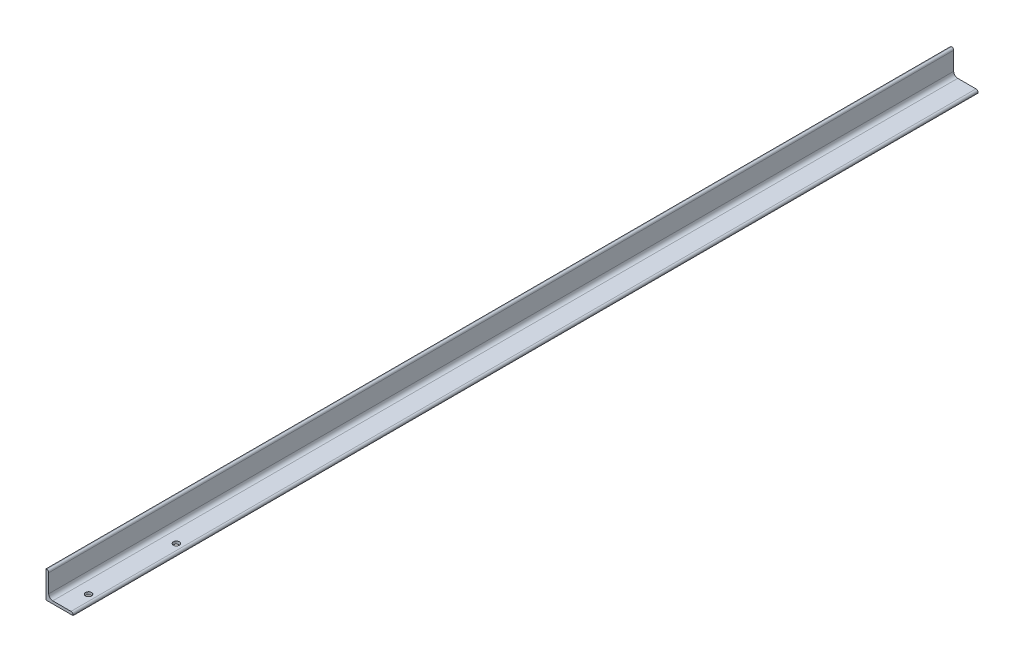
ISO-10303-21;
HEADER;
FILE_DESCRIPTION(('STEP AP214'),'2;1');
FILE_NAME('part.step','',(''),(''),'','','');
FILE_SCHEMA(('AUTOMOTIVE_DESIGN { 1 0 10303 214 1 1 1 1 }'));
ENDSEC;
DATA;
#1=APPLICATION_CONTEXT('core data for automotive mechanical design processes');
#2=APPLICATION_PROTOCOL_DEFINITION('international standard','automotive_design',2000,#1);
#3=PRODUCT_CONTEXT('',#1,'mechanical');
#4=PRODUCT('Part','Part','',(#3));
#5=PRODUCT_RELATED_PRODUCT_CATEGORY('part','',(#4));
#6=PRODUCT_DEFINITION_FORMATION('','',#4);
#7=PRODUCT_DEFINITION_CONTEXT('part definition',#1,'design');
#8=PRODUCT_DEFINITION('design','',#6,#7);
#9=PRODUCT_DEFINITION_SHAPE('','',#8);
#10=(LENGTH_UNIT() NAMED_UNIT(*) SI_UNIT(.MILLI.,.METRE.));
#11=(NAMED_UNIT(*) PLANE_ANGLE_UNIT() SI_UNIT($,.RADIAN.));
#12=(NAMED_UNIT(*) SI_UNIT($,.STERADIAN.) SOLID_ANGLE_UNIT());
#13=UNCERTAINTY_MEASURE_WITH_UNIT(LENGTH_MEASURE(1.E-05),#10,'distance_accuracy_value','');
#14=(GEOMETRIC_REPRESENTATION_CONTEXT(3) GLOBAL_UNCERTAINTY_ASSIGNED_CONTEXT((#13)) GLOBAL_UNIT_ASSIGNED_CONTEXT((#10,
#11,#12)) REPRESENTATION_CONTEXT('',''));
#15=CARTESIAN_POINT('',(0.,0.,0.));
#16=DIRECTION('',(0.,0.,1.));
#17=DIRECTION('',(1.,0.,0.));
#18=AXIS2_PLACEMENT_3D('',#15,#16,#17);
#19=CARTESIAN_POINT('',(20.,-20.,670.));
#20=DIRECTION('',(0.,1.,0.));
#21=DIRECTION('',(0.,0.,1.));
#22=AXIS2_PLACEMENT_3D('',#19,#20,#21);
#23=PLANE('',#22);
#24=CARTESIAN_POINT('',(8.,-20.,635.));
#25=DIRECTION('',(0.,-1.,0.));
#26=DIRECTION('',(0.,0.,-1.));
#27=AXIS2_PLACEMENT_3D('',#24,#25,#26);
#28=CIRCLE('',#27,4.5);
#29=CARTESIAN_POINT('',(8.,-20.,630.5));
#30=VERTEX_POINT('',#29);
#31=EDGE_CURVE('E204',#30,#30,#28,.T.);
#32=ORIENTED_EDGE('',*,*,#31,.F.);
#33=EDGE_LOOP('',(#32));
#34=FACE_BOUND('',#33,.T.);
#35=CARTESIAN_POINT('',(8.,-20.,505.));
#36=DIRECTION('',(0.,-1.,0.));
#37=DIRECTION('',(0.,0.,-1.));
#38=AXIS2_PLACEMENT_3D('',#35,#36,#37);
#39=CIRCLE('',#38,4.5);
#40=CARTESIAN_POINT('',(8.,-20.,500.5));
#41=VERTEX_POINT('',#40);
#42=EDGE_CURVE('E198',#41,#41,#39,.T.);
#43=ORIENTED_EDGE('',*,*,#42,.F.);
#44=EDGE_LOOP('',(#43));
#45=FACE_BOUND('',#44,.T.);
#46=DIRECTION('',(1.,0.,0.));
#47=VECTOR('',#46,1.);
#48=CARTESIAN_POINT('',(20.,-20.,-670.));
#49=LINE('',#48,#47);
#50=CARTESIAN_POINT('',(-20.,-20.,-670.));
#51=VERTEX_POINT('',#50);
#52=CARTESIAN_POINT('',(20.,-20.,-670.));
#53=VERTEX_POINT('',#52);
#54=EDGE_CURVE('E138',#51,#53,#49,.T.);
#55=ORIENTED_EDGE('',*,*,#54,.T.);
#56=DIRECTION('',(0.,0.,-1.));
#57=VECTOR('',#56,1.);
#58=CARTESIAN_POINT('',(20.,-20.,670.));
#59=LINE('',#58,#57);
#60=CARTESIAN_POINT('',(20.,-20.,670.));
#61=VERTEX_POINT('',#60);
#62=EDGE_CURVE('E11',#61,#53,#59,.T.);
#63=ORIENTED_EDGE('',*,*,#62,.F.);
#64=DIRECTION('',(1.,0.,0.));
#65=VECTOR('',#64,1.);
#66=CARTESIAN_POINT('',(20.,-20.,670.));
#67=LINE('',#66,#65);
#68=CARTESIAN_POINT('',(-20.,-20.,670.));
#69=VERTEX_POINT('',#68);
#70=EDGE_CURVE('E155',#69,#61,#67,.T.);
#71=ORIENTED_EDGE('',*,*,#70,.F.);
#72=DIRECTION('',(0.,0.,-1.));
#73=VECTOR('',#72,1.);
#74=CARTESIAN_POINT('',(-20.,-20.,670.));
#75=LINE('',#74,#73);
#76=EDGE_CURVE('E134',#69,#51,#75,.T.);
#77=ORIENTED_EDGE('',*,*,#76,.T.);
#78=EDGE_LOOP('',(#55,#63,#71,#77));
#79=FACE_BOUND('',#78,.T.);
#80=ADVANCED_FACE('F36',(#34,#45,#79),#23,.F.);
#81=CARTESIAN_POINT('',(20.,-20.,670.));
#82=DIRECTION('',(-1.,0.,0.));
#83=DIRECTION('',(0.,0.,1.));
#84=AXIS2_PLACEMENT_3D('',#81,#82,#83);
#85=PLANE('',#84);
#86=DIRECTION('',(0.,1.,0.));
#87=VECTOR('',#86,1.);
#88=CARTESIAN_POINT('',(20.,-20.,-670.));
#89=LINE('',#88,#87);
#90=CARTESIAN_POINT('',(20.,-19.,-670.));
#91=VERTEX_POINT('',#90);
#92=EDGE_CURVE('E141',#53,#91,#89,.T.);
#93=ORIENTED_EDGE('',*,*,#92,.T.);
#94=DIRECTION('',(0.,0.,-1.));
#95=VECTOR('',#94,1.);
#96=CARTESIAN_POINT('',(20.,-19.,670.));
#97=LINE('',#96,#95);
#98=CARTESIAN_POINT('',(20.,-19.,670.));
#99=VERTEX_POINT('',#98);
#100=EDGE_CURVE('E44',#99,#91,#97,.T.);
#101=ORIENTED_EDGE('',*,*,#100,.F.);
#102=DIRECTION('',(0.,1.,0.));
#103=VECTOR('',#102,1.);
#104=CARTESIAN_POINT('',(20.,-20.,670.));
#105=LINE('',#104,#103);
#106=EDGE_CURVE('E98',#61,#99,#105,.T.);
#107=ORIENTED_EDGE('',*,*,#106,.F.);
#108=ORIENTED_EDGE('',*,*,#62,.T.);
#109=EDGE_LOOP('',(#93,#101,#107,#108));
#110=FACE_BOUND('',#109,.T.);
#111=ADVANCED_FACE('F213',(#110),#85,.F.);
#112=CARTESIAN_POINT('',(17.,-19.,670.));
#113=DIRECTION('',(0.,0.,-1.));
#114=DIRECTION('',(-1.,0.,0.));
#115=AXIS2_PLACEMENT_3D('',#112,#113,#114);
#116=CYLINDRICAL_SURFACE('',#115,3.);
#117=CARTESIAN_POINT('',(17.,-19.,-670.));
#118=DIRECTION('',(0.,0.,1.));
#119=DIRECTION('',(1.,0.,0.));
#120=AXIS2_PLACEMENT_3D('',#117,#118,#119);
#121=CIRCLE('',#120,3.);
#122=CARTESIAN_POINT('',(17.,-16.,-670.));
#123=VERTEX_POINT('',#122);
#124=EDGE_CURVE('E144',#91,#123,#121,.T.);
#125=ORIENTED_EDGE('',*,*,#124,.T.);
#126=DIRECTION('',(0.,0.,-1.));
#127=VECTOR('',#126,1.);
#128=CARTESIAN_POINT('',(17.,-16.,670.));
#129=LINE('',#128,#127);
#130=CARTESIAN_POINT('',(17.,-16.,670.));
#131=VERTEX_POINT('',#130);
#132=EDGE_CURVE('E165',#131,#123,#129,.T.);
#133=ORIENTED_EDGE('',*,*,#132,.F.);
#134=CARTESIAN_POINT('',(17.,-19.,670.));
#135=DIRECTION('',(0.,0.,1.));
#136=DIRECTION('',(1.,0.,0.));
#137=AXIS2_PLACEMENT_3D('',#134,#135,#136);
#138=CIRCLE('',#137,3.);
#139=EDGE_CURVE('E173',#99,#131,#138,.T.);
#140=ORIENTED_EDGE('',*,*,#139,.F.);
#141=ORIENTED_EDGE('',*,*,#100,.T.);
#142=EDGE_LOOP('',(#125,#133,#140,#141));
#143=FACE_BOUND('',#142,.T.);
#144=ADVANCED_FACE('F171',(#143),#116,.T.);
#145=CARTESIAN_POINT('',(-10.,-16.,670.));
#146=DIRECTION('',(0.,-1.,0.));
#147=DIRECTION('',(0.,0.,-1.));
#148=AXIS2_PLACEMENT_3D('',#145,#146,#147);
#149=PLANE('',#148);
#150=CARTESIAN_POINT('',(8.,-16.,635.));
#151=DIRECTION('',(0.,-1.,0.));
#152=DIRECTION('',(0.,0.,-1.));
#153=AXIS2_PLACEMENT_3D('',#150,#151,#152);
#154=CIRCLE('',#153,4.5);
#155=CARTESIAN_POINT('',(8.,-16.,630.5));
#156=VERTEX_POINT('',#155);
#157=EDGE_CURVE('E201',#156,#156,#154,.T.);
#158=ORIENTED_EDGE('',*,*,#157,.T.);
#159=EDGE_LOOP('',(#158));
#160=FACE_BOUND('',#159,.T.);
#161=CARTESIAN_POINT('',(8.,-16.,505.));
#162=DIRECTION('',(0.,-1.,0.));
#163=DIRECTION('',(0.,0.,-1.));
#164=AXIS2_PLACEMENT_3D('',#161,#162,#163);
#165=CIRCLE('',#164,4.5);
#166=CARTESIAN_POINT('',(8.,-16.,500.5));
#167=VERTEX_POINT('',#166);
#168=EDGE_CURVE('E142',#167,#167,#165,.T.);
#169=ORIENTED_EDGE('',*,*,#168,.T.);
#170=EDGE_LOOP('',(#169));
#171=FACE_BOUND('',#170,.T.);
#172=DIRECTION('',(-1.,0.,0.));
#173=VECTOR('',#172,1.);
#174=CARTESIAN_POINT('',(-10.,-16.,-670.));
#175=LINE('',#174,#173);
#176=CARTESIAN_POINT('',(-10.,-16.,-670.));
#177=VERTEX_POINT('',#176);
#178=EDGE_CURVE('E146',#123,#177,#175,.T.);
#179=ORIENTED_EDGE('',*,*,#178,.T.);
#180=DIRECTION('',(0.,0.,-1.));
#181=VECTOR('',#180,1.);
#182=CARTESIAN_POINT('',(-10.,-16.,670.));
#183=LINE('',#182,#181);
#184=CARTESIAN_POINT('',(-10.,-16.,670.));
#185=VERTEX_POINT('',#184);
#186=EDGE_CURVE('E162',#185,#177,#183,.T.);
#187=ORIENTED_EDGE('',*,*,#186,.F.);
#188=DIRECTION('',(-1.,0.,0.));
#189=VECTOR('',#188,1.);
#190=CARTESIAN_POINT('',(-10.,-16.,670.));
#191=LINE('',#190,#189);
#192=EDGE_CURVE('E189',#131,#185,#191,.T.);
#193=ORIENTED_EDGE('',*,*,#192,.F.);
#194=ORIENTED_EDGE('',*,*,#132,.T.);
#195=EDGE_LOOP('',(#179,#187,#193,#194));
#196=FACE_BOUND('',#195,.T.);
#197=ADVANCED_FACE('F182',(#160,#171,#196),#149,.F.);
#198=CARTESIAN_POINT('',(-10.,-10.,670.));
#199=DIRECTION('',(0.,0.,-1.));
#200=DIRECTION('',(-1.,0.,0.));
#201=AXIS2_PLACEMENT_3D('',#198,#199,#200);
#202=CYLINDRICAL_SURFACE('',#201,6.);
#203=CARTESIAN_POINT('',(-10.,-10.,-670.));
#204=DIRECTION('',(0.,0.,-1.));
#205=DIRECTION('',(-1.,0.,0.));
#206=AXIS2_PLACEMENT_3D('',#203,#204,#205);
#207=CIRCLE('',#206,6.);
#208=CARTESIAN_POINT('',(-16.,-10.,-670.));
#209=VERTEX_POINT('',#208);
#210=EDGE_CURVE('E148',#177,#209,#207,.T.);
#211=ORIENTED_EDGE('',*,*,#210,.T.);
#212=DIRECTION('',(0.,0.,-1.));
#213=VECTOR('',#212,1.);
#214=CARTESIAN_POINT('',(-16.,-10.,670.));
#215=LINE('',#214,#213);
#216=CARTESIAN_POINT('',(-16.,-10.,670.));
#217=VERTEX_POINT('',#216);
#218=EDGE_CURVE('E159',#217,#209,#215,.T.);
#219=ORIENTED_EDGE('',*,*,#218,.F.);
#220=CARTESIAN_POINT('',(-10.,-10.,670.));
#221=DIRECTION('',(0.,0.,-1.));
#222=DIRECTION('',(-1.,0.,0.));
#223=AXIS2_PLACEMENT_3D('',#220,#221,#222);
#224=CIRCLE('',#223,6.);
#225=EDGE_CURVE('E188',#185,#217,#224,.T.);
#226=ORIENTED_EDGE('',*,*,#225,.F.);
#227=ORIENTED_EDGE('',*,*,#186,.T.);
#228=EDGE_LOOP('',(#211,#219,#226,#227));
#229=FACE_BOUND('',#228,.T.);
#230=ADVANCED_FACE('F186',(#229),#202,.F.);
#231=CARTESIAN_POINT('',(-16.,17.,670.));
#232=DIRECTION('',(-1.,0.,0.));
#233=DIRECTION('',(0.,-1.,0.));
#234=AXIS2_PLACEMENT_3D('',#231,#232,#233);
#235=PLANE('',#234);
#236=DIRECTION('',(0.,1.,0.));
#237=VECTOR('',#236,1.);
#238=CARTESIAN_POINT('',(-16.,17.,-670.));
#239=LINE('',#238,#237);
#240=CARTESIAN_POINT('',(-16.,17.,-670.));
#241=VERTEX_POINT('',#240);
#242=EDGE_CURVE('E150',#209,#241,#239,.T.);
#243=ORIENTED_EDGE('',*,*,#242,.T.);
#244=DIRECTION('',(0.,0.,-1.));
#245=VECTOR('',#244,1.);
#246=CARTESIAN_POINT('',(-16.,17.,670.));
#247=LINE('',#246,#245);
#248=CARTESIAN_POINT('',(-16.,17.,670.));
#249=VERTEX_POINT('',#248);
#250=EDGE_CURVE('E129',#249,#241,#247,.T.);
#251=ORIENTED_EDGE('',*,*,#250,.F.);
#252=DIRECTION('',(0.,1.,0.));
#253=VECTOR('',#252,1.);
#254=CARTESIAN_POINT('',(-16.,17.,670.));
#255=LINE('',#254,#253);
#256=EDGE_CURVE('E120',#217,#249,#255,.T.);
#257=ORIENTED_EDGE('',*,*,#256,.F.);
#258=ORIENTED_EDGE('',*,*,#218,.T.);
#259=EDGE_LOOP('',(#243,#251,#257,#258));
#260=FACE_BOUND('',#259,.T.);
#261=ADVANCED_FACE('F219',(#260),#235,.F.);
#262=CARTESIAN_POINT('',(-19.,17.,670.));
#263=DIRECTION('',(0.,0.,-1.));
#264=DIRECTION('',(-1.,0.,0.));
#265=AXIS2_PLACEMENT_3D('',#262,#263,#264);
#266=CYLINDRICAL_SURFACE('',#265,3.);
#267=CARTESIAN_POINT('',(-19.,17.,-670.));
#268=DIRECTION('',(0.,0.,1.));
#269=DIRECTION('',(-1.,0.,0.));
#270=AXIS2_PLACEMENT_3D('',#267,#268,#269);
#271=CIRCLE('',#270,3.);
#272=CARTESIAN_POINT('',(-19.,20.,-670.));
#273=VERTEX_POINT('',#272);
#274=EDGE_CURVE('E128',#241,#273,#271,.T.);
#275=ORIENTED_EDGE('',*,*,#274,.T.);
#276=DIRECTION('',(0.,0.,-1.));
#277=VECTOR('',#276,1.);
#278=CARTESIAN_POINT('',(-19.,20.,670.));
#279=LINE('',#278,#277);
#280=CARTESIAN_POINT('',(-19.,20.,670.));
#281=VERTEX_POINT('',#280);
#282=EDGE_CURVE('E125',#281,#273,#279,.T.);
#283=ORIENTED_EDGE('',*,*,#282,.F.);
#284=CARTESIAN_POINT('',(-19.,17.,670.));
#285=DIRECTION('',(0.,0.,1.));
#286=DIRECTION('',(-1.,0.,0.));
#287=AXIS2_PLACEMENT_3D('',#284,#285,#286);
#288=CIRCLE('',#287,3.);
#289=EDGE_CURVE('E114',#249,#281,#288,.T.);
#290=ORIENTED_EDGE('',*,*,#289,.F.);
#291=ORIENTED_EDGE('',*,*,#250,.T.);
#292=EDGE_LOOP('',(#275,#283,#290,#291));
#293=FACE_BOUND('',#292,.T.);
#294=ADVANCED_FACE('F126',(#293),#266,.T.);
#295=CARTESIAN_POINT('',(-20.,20.,670.));
#296=DIRECTION('',(0.,-1.,0.));
#297=DIRECTION('',(1.,0.,0.));
#298=AXIS2_PLACEMENT_3D('',#295,#296,#297);
#299=PLANE('',#298);
#300=DIRECTION('',(-1.,0.,0.));
#301=VECTOR('',#300,1.);
#302=CARTESIAN_POINT('',(-20.,20.,-670.));
#303=LINE('',#302,#301);
#304=CARTESIAN_POINT('',(-20.,20.,-670.));
#305=VERTEX_POINT('',#304);
#306=EDGE_CURVE('E84',#273,#305,#303,.T.);
#307=ORIENTED_EDGE('',*,*,#306,.T.);
#308=DIRECTION('',(0.,0.,-1.));
#309=VECTOR('',#308,1.);
#310=CARTESIAN_POINT('',(-20.,20.,670.));
#311=LINE('',#310,#309);
#312=CARTESIAN_POINT('',(-20.,20.,670.));
#313=VERTEX_POINT('',#312);
#314=EDGE_CURVE('E130',#313,#305,#311,.T.);
#315=ORIENTED_EDGE('',*,*,#314,.F.);
#316=DIRECTION('',(-1.,0.,0.));
#317=VECTOR('',#316,1.);
#318=CARTESIAN_POINT('',(-20.,20.,670.));
#319=LINE('',#318,#317);
#320=EDGE_CURVE('E118',#281,#313,#319,.T.);
#321=ORIENTED_EDGE('',*,*,#320,.F.);
#322=ORIENTED_EDGE('',*,*,#282,.T.);
#323=EDGE_LOOP('',(#307,#315,#321,#322));
#324=FACE_BOUND('',#323,.T.);
#325=ADVANCED_FACE('F132',(#324),#299,.F.);
#326=CARTESIAN_POINT('',(-20.,-20.,670.));
#327=DIRECTION('',(1.,0.,0.));
#328=DIRECTION('',(0.,0.,-1.));
#329=AXIS2_PLACEMENT_3D('',#326,#327,#328);
#330=PLANE('',#329);
#331=DIRECTION('',(0.,-1.,0.));
#332=VECTOR('',#331,1.);
#333=CARTESIAN_POINT('',(-20.,-20.,-670.));
#334=LINE('',#333,#332);
#335=EDGE_CURVE('E90',#305,#51,#334,.T.);
#336=ORIENTED_EDGE('',*,*,#335,.T.);
#337=ORIENTED_EDGE('',*,*,#76,.F.);
#338=DIRECTION('',(0.,-1.,0.));
#339=VECTOR('',#338,1.);
#340=CARTESIAN_POINT('',(-20.,-20.,670.));
#341=LINE('',#340,#339);
#342=EDGE_CURVE('E52',#313,#69,#341,.T.);
#343=ORIENTED_EDGE('',*,*,#342,.F.);
#344=ORIENTED_EDGE('',*,*,#314,.T.);
#345=EDGE_LOOP('',(#336,#337,#343,#344));
#346=FACE_BOUND('',#345,.T.);
#347=ADVANCED_FACE('F271',(#346),#330,.F.);
#348=CARTESIAN_POINT('',(-19.,17.,670.));
#349=DIRECTION('',(0.,0.,-1.));
#350=DIRECTION('',(-1.,0.,0.));
#351=AXIS2_PLACEMENT_3D('',#348,#349,#350);
#352=PLANE('',#351);
#353=ORIENTED_EDGE('',*,*,#70,.T.);
#354=ORIENTED_EDGE('',*,*,#106,.T.);
#355=ORIENTED_EDGE('',*,*,#139,.T.);
#356=ORIENTED_EDGE('',*,*,#192,.T.);
#357=ORIENTED_EDGE('',*,*,#225,.T.);
#358=ORIENTED_EDGE('',*,*,#256,.T.);
#359=ORIENTED_EDGE('',*,*,#289,.T.);
#360=ORIENTED_EDGE('',*,*,#320,.T.);
#361=ORIENTED_EDGE('',*,*,#342,.T.);
#362=EDGE_LOOP('',(#353,#354,#355,#356,#357,#358,#359,#360,#361));
#363=FACE_BOUND('',#362,.T.);
#364=ADVANCED_FACE('F116',(#363),#352,.F.);
#365=CARTESIAN_POINT('',(-19.,17.,-670.));
#366=DIRECTION('',(0.,0.,-1.));
#367=DIRECTION('',(-1.,0.,0.));
#368=AXIS2_PLACEMENT_3D('',#365,#366,#367);
#369=PLANE('',#368);
#370=ORIENTED_EDGE('',*,*,#54,.F.);
#371=ORIENTED_EDGE('',*,*,#335,.F.);
#372=ORIENTED_EDGE('',*,*,#306,.F.);
#373=ORIENTED_EDGE('',*,*,#274,.F.);
#374=ORIENTED_EDGE('',*,*,#242,.F.);
#375=ORIENTED_EDGE('',*,*,#210,.F.);
#376=ORIENTED_EDGE('',*,*,#178,.F.);
#377=ORIENTED_EDGE('',*,*,#124,.F.);
#378=ORIENTED_EDGE('',*,*,#92,.F.);
#379=EDGE_LOOP('',(#370,#371,#372,#373,#374,#375,#376,#377,#378));
#380=FACE_BOUND('',#379,.T.);
#381=ADVANCED_FACE('F177',(#380),#369,.T.);
#382=CARTESIAN_POINT('',(8.,-20.,505.));
#383=DIRECTION('',(0.,-1.,0.));
#384=DIRECTION('',(0.,0.,-1.));
#385=AXIS2_PLACEMENT_3D('',#382,#383,#384);
#386=CYLINDRICAL_SURFACE('',#385,4.5);
#387=ORIENTED_EDGE('',*,*,#42,.T.);
#388=EDGE_LOOP('',(#387));
#389=FACE_BOUND('',#388,.T.);
#390=ORIENTED_EDGE('',*,*,#168,.F.);
#391=EDGE_LOOP('',(#390));
#392=FACE_BOUND('',#391,.T.);
#393=ADVANCED_FACE('F294',(#389,#392),#386,.F.);
#394=CARTESIAN_POINT('',(8.,-20.,635.));
#395=DIRECTION('',(0.,-1.,0.));
#396=DIRECTION('',(0.,0.,-1.));
#397=AXIS2_PLACEMENT_3D('',#394,#395,#396);
#398=CYLINDRICAL_SURFACE('',#397,4.5);
#399=ORIENTED_EDGE('',*,*,#31,.T.);
#400=EDGE_LOOP('',(#399));
#401=FACE_BOUND('',#400,.T.);
#402=ORIENTED_EDGE('',*,*,#157,.F.);
#403=EDGE_LOOP('',(#402));
#404=FACE_BOUND('',#403,.T.);
#405=ADVANCED_FACE('F208',(#401,#404),#398,.F.);
#406=CLOSED_SHELL('',(#80,#111,#144,#197,#230,#261,#294,#325,#347,#364,#381,#393,#405));
#407=MANIFOLD_SOLID_BREP('B2',#406);
#408=ADVANCED_BREP_SHAPE_REPRESENTATION('',(#18,#407),#14);
#409=SHAPE_DEFINITION_REPRESENTATION(#9,#408);
ENDSEC;
END-ISO-10303-21;
